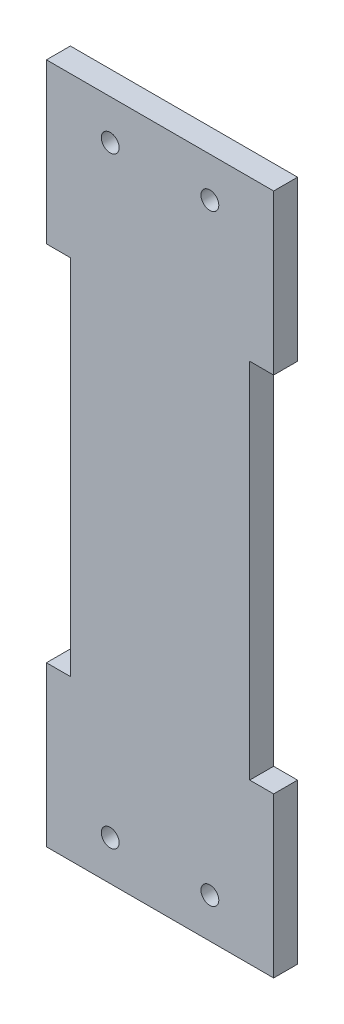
from build123d import *

# Parameters (mm, degrees)
ESQUISSE1_W               = 45
ESQUISSE1_H               = 171
BOSS_EXTRU_1_DEPTH        = 6
ESQUISSE2_W               = 6
ESQUISSE2_H               = 40
BOSS_EXTRU_2_DEPTH        = 6
ESQUISSE4_R               = 2.234668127
ENL_V_MAT_EXTRU_1_DEPTH   = 6
SYM_TRIE3_COPY_1_SKETCH_W = 6
SYM_TRIE3_COPY_1_SKETCH_H = 40
SYM_TRIE3_COPY_1_DEPTH    = 6
SYM_TRIE4_COPY_1_SKETCH_R = 2.234668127
SYM_TRIE4_COPY_1_DEPTH    = 6


with BuildPart() as part:
    # Esquisse1 → Boss.-Extru.1 (new body)
    with BuildSketch(Plane.XY):
        Rectangle(ESQUISSE1_W, ESQUISSE1_H)
    extrude(amount=BOSS_EXTRU_1_DEPTH)

    # Esquisse2 → Boss.-Extru.2 (add)
    with BuildSketch(Plane.XY.offset(6)):
        with Locations((-25.5, 65.5)):
            Rectangle(ESQUISSE2_W, ESQUISSE2_H)
    boss_extru_2 = extrude(amount=-BOSS_EXTRU_2_DEPTH)

    # Esquisse4 → Enl_v. mat.-Extru.1 (cut)
    with BuildSketch(Plane.XY.offset(6)):
        with Locations((-12.5, -75.5)):
            Circle(ESQUISSE4_R)
    enl_v_mat_extru_1 = extrude(amount=-ENL_V_MAT_EXTRU_1_DEPTH, mode=Mode.SUBTRACT)

    # Sym_trie1: Enl_v. mat.-Extru.1 across plane
    add(enl_v_mat_extru_1.mirror(Plane(origin=(0, 0, 0), x_dir=(0, 0, 1), z_dir=(1, 0, 0))), mode=Mode.SUBTRACT)

    # Sym_trie2: Boss.-Extru.2 across plane
    add(boss_extru_2.mirror(Plane(origin=(0, 0, 0), x_dir=(0, 0, 1), z_dir=(1, 0, 0))))

    # Sym_trie3: Boss.-Extru.2 across plane
    add(boss_extru_2.mirror(Plane.ZX))

    # Sym_trie3 copy 1 sketch → Sym_trie3 copy 1 (add)
    with BuildSketch(Plane(origin=(0, 0, 6), x_dir=(-1, 0, 0), z_dir=(0, 0, 1))):
        with Locations((-25.5, 65.5)):
            Rectangle(SYM_TRIE3_COPY_1_SKETCH_W, SYM_TRIE3_COPY_1_SKETCH_H)
    extrude(amount=-SYM_TRIE3_COPY_1_DEPTH)

    # Sym_trie4: Enl_v. mat.-Extru.1 across plane
    add(enl_v_mat_extru_1.mirror(Plane.ZX), mode=Mode.SUBTRACT)

    # Sym_trie4 copy 1 sketch → Sym_trie4 copy 1 (cut)
    with BuildSketch(Plane(origin=(0, 0, 6), x_dir=(-1, 0, 0), z_dir=(0, 0, 1))):
        with Locations((-12.5, -75.5)):
            Circle(SYM_TRIE4_COPY_1_SKETCH_R)
    extrude(amount=-SYM_TRIE4_COPY_1_DEPTH, mode=Mode.SUBTRACT)


solid = part.part
